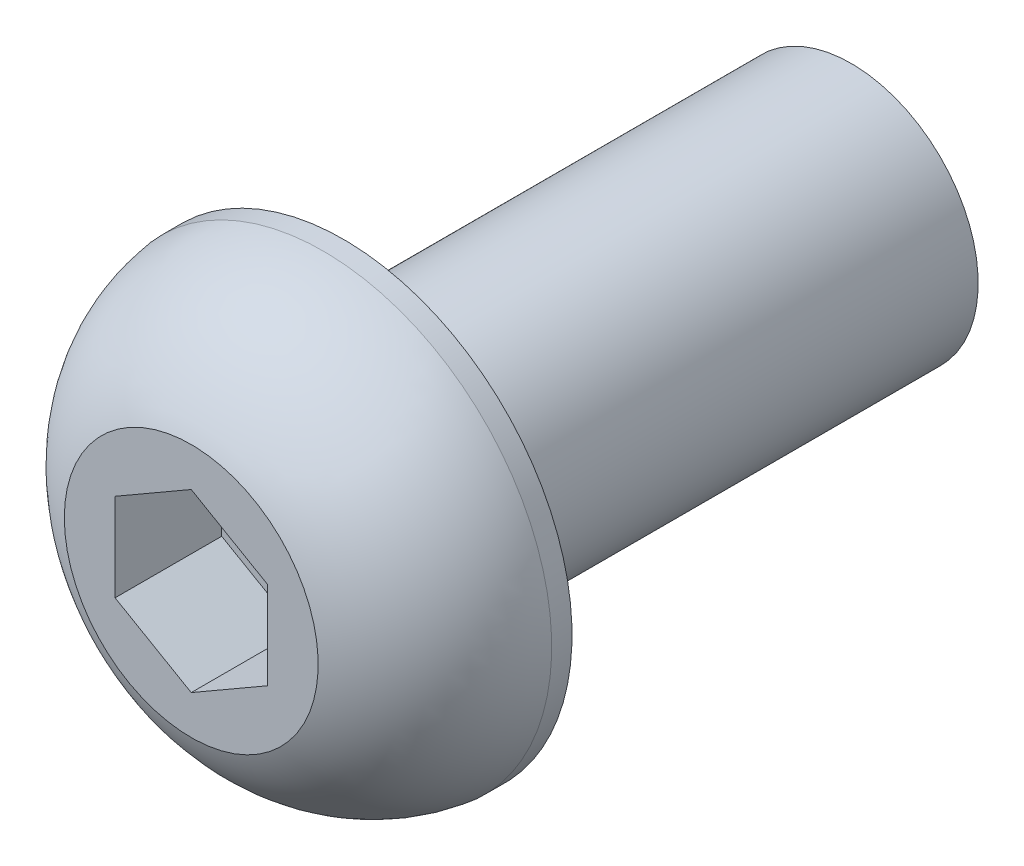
ISO-10303-21;
HEADER;
FILE_DESCRIPTION(('STEP AP214'),'2;1');
FILE_NAME('part.step','',(''),(''),'','','');
FILE_SCHEMA(('AUTOMOTIVE_DESIGN { 1 0 10303 214 1 1 1 1 }'));
ENDSEC;
DATA;
#1=APPLICATION_CONTEXT('core data for automotive mechanical design processes');
#2=APPLICATION_PROTOCOL_DEFINITION('international standard','automotive_design',2000,#1);
#3=PRODUCT_CONTEXT('',#1,'mechanical');
#4=PRODUCT('Part','Part','',(#3));
#5=PRODUCT_RELATED_PRODUCT_CATEGORY('part','',(#4));
#6=PRODUCT_DEFINITION_FORMATION('','',#4);
#7=PRODUCT_DEFINITION_CONTEXT('part definition',#1,'design');
#8=PRODUCT_DEFINITION('design','',#6,#7);
#9=PRODUCT_DEFINITION_SHAPE('','',#8);
#10=(LENGTH_UNIT() NAMED_UNIT(*) SI_UNIT(.MILLI.,.METRE.));
#11=(NAMED_UNIT(*) PLANE_ANGLE_UNIT() SI_UNIT($,.RADIAN.));
#12=(NAMED_UNIT(*) SI_UNIT($,.STERADIAN.) SOLID_ANGLE_UNIT());
#13=UNCERTAINTY_MEASURE_WITH_UNIT(LENGTH_MEASURE(1.E-05),#10,'distance_accuracy_value','');
#14=(GEOMETRIC_REPRESENTATION_CONTEXT(3) GLOBAL_UNCERTAINTY_ASSIGNED_CONTEXT((#13)) GLOBAL_UNIT_ASSIGNED_CONTEXT((#10,
#11,#12)) REPRESENTATION_CONTEXT('',''));
#15=CARTESIAN_POINT('',(0.,0.,0.));
#16=DIRECTION('',(0.,0.,1.));
#17=DIRECTION('',(1.,0.,0.));
#18=AXIS2_PLACEMENT_3D('',#15,#16,#17);
#19=CARTESIAN_POINT('',(0.,0.,6.));
#20=DIRECTION('',(0.,0.,1.));
#21=DIRECTION('',(1.,0.,0.));
#22=AXIS2_PLACEMENT_3D('',#19,#20,#21);
#23=PLANE('',#22);
#24=DIRECTION('',(-0.866025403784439,0.5,0.));
#25=VECTOR('',#24,1.);
#26=CARTESIAN_POINT('',(3.,1.73205080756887,6.));
#27=LINE('',#26,#25);
#28=CARTESIAN_POINT('',(3.,1.73205080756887,6.));
#29=VERTEX_POINT('',#28);
#30=CARTESIAN_POINT('',(0.,3.46410161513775,6.));
#31=VERTEX_POINT('',#30);
#32=EDGE_CURVE('E28',#29,#31,#27,.T.);
#33=ORIENTED_EDGE('',*,*,#32,.F.);
#34=DIRECTION('',(0.,1.,0.));
#35=VECTOR('',#34,1.);
#36=CARTESIAN_POINT('',(3.,-1.73205080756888,6.));
#37=LINE('',#36,#35);
#38=CARTESIAN_POINT('',(3.,-1.73205080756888,6.));
#39=VERTEX_POINT('',#38);
#40=EDGE_CURVE('E97',#39,#29,#37,.T.);
#41=ORIENTED_EDGE('',*,*,#40,.F.);
#42=DIRECTION('',(0.866025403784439,0.5,0.));
#43=VECTOR('',#42,1.);
#44=CARTESIAN_POINT('',(0.,-3.46410161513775,6.));
#45=LINE('',#44,#43);
#46=CARTESIAN_POINT('',(0.,-3.46410161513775,6.));
#47=VERTEX_POINT('',#46);
#48=EDGE_CURVE('E91',#47,#39,#45,.T.);
#49=ORIENTED_EDGE('',*,*,#48,.F.);
#50=DIRECTION('',(0.866025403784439,-0.5,0.));
#51=VECTOR('',#50,1.);
#52=CARTESIAN_POINT('',(-3.,-1.73205080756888,6.));
#53=LINE('',#52,#51);
#54=CARTESIAN_POINT('',(-3.,-1.73205080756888,6.));
#55=VERTEX_POINT('',#54);
#56=EDGE_CURVE('E89',#55,#47,#53,.T.);
#57=ORIENTED_EDGE('',*,*,#56,.F.);
#58=DIRECTION('',(0.,-1.,0.));
#59=VECTOR('',#58,1.);
#60=CARTESIAN_POINT('',(-3.,1.73205080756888,6.));
#61=LINE('',#60,#59);
#62=CARTESIAN_POINT('',(-3.,1.73205080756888,6.));
#63=VERTEX_POINT('',#62);
#64=EDGE_CURVE('E71',#63,#55,#61,.T.);
#65=ORIENTED_EDGE('',*,*,#64,.F.);
#66=DIRECTION('',(-0.866025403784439,-0.5,0.));
#67=VECTOR('',#66,1.);
#68=CARTESIAN_POINT('',(0.,3.46410161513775,6.));
#69=LINE('',#68,#67);
#70=EDGE_CURVE('E82',#31,#63,#69,.T.);
#71=ORIENTED_EDGE('',*,*,#70,.F.);
#72=EDGE_LOOP('',(#33,#41,#49,#57,#65,#71));
#73=FACE_BOUND('',#72,.T.);
#74=CARTESIAN_POINT('',(0.,0.,6.));
#75=DIRECTION('',(0.,0.,-1.));
#76=DIRECTION('',(-1.,0.,0.));
#77=AXIS2_PLACEMENT_3D('',#74,#75,#76);
#78=CIRCLE('',#77,5.);
#79=CARTESIAN_POINT('',(-5.,0.,6.));
#80=VERTEX_POINT('',#79);
#81=EDGE_CURVE('E9',#80,#80,#78,.T.);
#82=ORIENTED_EDGE('',*,*,#81,.F.);
#83=EDGE_LOOP('',(#82));
#84=FACE_BOUND('',#83,.T.);
#85=ADVANCED_FACE('F14',(#73,#84),#23,.T.);
#86=CARTESIAN_POINT('',(0.,0.,-0.0214499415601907));
#87=DIRECTION('',(0.,0.,-1.));
#88=DIRECTION('',(-1.,0.,0.));
#89=AXIS2_PLACEMENT_3D('',#86,#87,#88);
#90=DEGENERATE_TOROIDAL_SURFACE('',#89,2.55211507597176,6.5,.T.);
#91=ORIENTED_EDGE('',*,*,#81,.T.);
#92=EDGE_LOOP('',(#91));
#93=FACE_BOUND('',#92,.T.);
#94=CARTESIAN_POINT('',(0.,0.,0.8));
#95=DIRECTION('',(0.,0.,-1.));
#96=DIRECTION('',(-1.,0.,0.));
#97=AXIS2_PLACEMENT_3D('',#94,#95,#96);
#98=CIRCLE('',#97,9.);
#99=CARTESIAN_POINT('',(-9.,0.,0.8));
#100=VERTEX_POINT('',#99);
#101=EDGE_CURVE('E21',#100,#100,#98,.T.);
#102=ORIENTED_EDGE('',*,*,#101,.F.);
#103=EDGE_LOOP('',(#102));
#104=FACE_BOUND('',#103,.T.);
#105=ADVANCED_FACE('F135',(#93,#104),#90,.T.);
#106=CARTESIAN_POINT('',(0.,0.,0.));
#107=DIRECTION('',(0.,0.,-1.));
#108=DIRECTION('',(-1.,0.,0.));
#109=AXIS2_PLACEMENT_3D('',#106,#107,#108);
#110=CYLINDRICAL_SURFACE('',#109,9.);
#111=ORIENTED_EDGE('',*,*,#101,.T.);
#112=EDGE_LOOP('',(#111));
#113=FACE_BOUND('',#112,.T.);
#114=CARTESIAN_POINT('',(0.,0.,0.));
#115=DIRECTION('',(0.,0.,-1.));
#116=DIRECTION('',(-1.,0.,0.));
#117=AXIS2_PLACEMENT_3D('',#114,#115,#116);
#118=CIRCLE('',#117,9.);
#119=CARTESIAN_POINT('',(-9.,0.,0.));
#120=VERTEX_POINT('',#119);
#121=EDGE_CURVE('E127',#120,#120,#118,.T.);
#122=ORIENTED_EDGE('',*,*,#121,.F.);
#123=EDGE_LOOP('',(#122));
#124=FACE_BOUND('',#123,.T.);
#125=ADVANCED_FACE('F132',(#113,#124),#110,.T.);
#126=CARTESIAN_POINT('',(0.,5.,0.));
#127=DIRECTION('',(0.,0.,-1.));
#128=DIRECTION('',(-1.,0.,0.));
#129=AXIS2_PLACEMENT_3D('',#126,#127,#128);
#130=PLANE('',#129);
#131=ORIENTED_EDGE('',*,*,#121,.T.);
#132=EDGE_LOOP('',(#131));
#133=FACE_BOUND('',#132,.T.);
#134=CARTESIAN_POINT('',(0.,0.,0.));
#135=DIRECTION('',(0.,0.,-1.));
#136=DIRECTION('',(-1.,0.,0.));
#137=AXIS2_PLACEMENT_3D('',#134,#135,#136);
#138=CIRCLE('',#137,5.);
#139=CARTESIAN_POINT('',(-5.,0.,0.));
#140=VERTEX_POINT('',#139);
#141=EDGE_CURVE('E124',#140,#140,#138,.T.);
#142=ORIENTED_EDGE('',*,*,#141,.F.);
#143=EDGE_LOOP('',(#142));
#144=FACE_BOUND('',#143,.T.);
#145=ADVANCED_FACE('F144',(#133,#144),#130,.T.);
#146=CARTESIAN_POINT('',(0.,0.,0.));
#147=DIRECTION('',(0.,0.,-1.));
#148=DIRECTION('',(-1.,0.,0.));
#149=AXIS2_PLACEMENT_3D('',#146,#147,#148);
#150=CYLINDRICAL_SURFACE('',#149,5.);
#151=ORIENTED_EDGE('',*,*,#141,.T.);
#152=EDGE_LOOP('',(#151));
#153=FACE_BOUND('',#152,.T.);
#154=CARTESIAN_POINT('',(0.,0.,-20.));
#155=DIRECTION('',(0.,0.,-1.));
#156=DIRECTION('',(-1.,0.,0.));
#157=AXIS2_PLACEMENT_3D('',#154,#155,#156);
#158=CIRCLE('',#157,5.);
#159=CARTESIAN_POINT('',(-5.,0.,-20.));
#160=VERTEX_POINT('',#159);
#161=EDGE_CURVE('E115',#160,#160,#158,.T.);
#162=ORIENTED_EDGE('',*,*,#161,.F.);
#163=EDGE_LOOP('',(#162));
#164=FACE_BOUND('',#163,.T.);
#165=ADVANCED_FACE('F149',(#153,#164),#150,.T.);
#166=CARTESIAN_POINT('',(0.,0.,-20.));
#167=DIRECTION('',(0.,0.,-1.));
#168=DIRECTION('',(-1.,0.,0.));
#169=AXIS2_PLACEMENT_3D('',#166,#167,#168);
#170=PLANE('',#169);
#171=ORIENTED_EDGE('',*,*,#161,.T.);
#172=EDGE_LOOP('',(#171));
#173=FACE_BOUND('',#172,.T.);
#174=ADVANCED_FACE('F153',(#173),#170,.T.);
#175=CARTESIAN_POINT('',(3.,1.73205080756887,1.8));
#176=DIRECTION('',(0.5,0.866025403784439,0.));
#177=DIRECTION('',(-0.866025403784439,0.5,0.));
#178=AXIS2_PLACEMENT_3D('',#175,#176,#177);
#179=PLANE('',#178);
#180=ORIENTED_EDGE('',*,*,#32,.T.);
#181=DIRECTION('',(0.,0.,1.));
#182=VECTOR('',#181,1.);
#183=CARTESIAN_POINT('',(0.,3.46410161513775,1.8));
#184=LINE('',#183,#182);
#185=CARTESIAN_POINT('',(0.,3.46410161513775,1.8));
#186=VERTEX_POINT('',#185);
#187=EDGE_CURVE('E79',#186,#31,#184,.T.);
#188=ORIENTED_EDGE('',*,*,#187,.F.);
#189=DIRECTION('',(-0.866025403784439,0.5,0.));
#190=VECTOR('',#189,1.);
#191=CARTESIAN_POINT('',(3.,1.73205080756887,1.8));
#192=LINE('',#191,#190);
#193=CARTESIAN_POINT('',(3.,1.73205080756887,1.8));
#194=VERTEX_POINT('',#193);
#195=EDGE_CURVE('E99',#194,#186,#192,.T.);
#196=ORIENTED_EDGE('',*,*,#195,.F.);
#197=DIRECTION('',(0.,0.,1.));
#198=VECTOR('',#197,1.);
#199=CARTESIAN_POINT('',(3.,1.73205080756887,1.8));
#200=LINE('',#199,#198);
#201=EDGE_CURVE('E35',#194,#29,#200,.T.);
#202=ORIENTED_EDGE('',*,*,#201,.T.);
#203=EDGE_LOOP('',(#180,#188,#196,#202));
#204=FACE_BOUND('',#203,.T.);
#205=ADVANCED_FACE('F157',(#204),#179,.F.);
#206=CARTESIAN_POINT('',(3.,-1.73205080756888,1.8));
#207=DIRECTION('',(1.,0.,0.));
#208=DIRECTION('',(0.,1.,0.));
#209=AXIS2_PLACEMENT_3D('',#206,#207,#208);
#210=PLANE('',#209);
#211=ORIENTED_EDGE('',*,*,#40,.T.);
#212=ORIENTED_EDGE('',*,*,#201,.F.);
#213=DIRECTION('',(0.,1.,0.));
#214=VECTOR('',#213,1.);
#215=CARTESIAN_POINT('',(3.,-1.73205080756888,1.8));
#216=LINE('',#215,#214);
#217=CARTESIAN_POINT('',(3.,-1.73205080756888,1.8));
#218=VERTEX_POINT('',#217);
#219=EDGE_CURVE('E111',#218,#194,#216,.T.);
#220=ORIENTED_EDGE('',*,*,#219,.F.);
#221=DIRECTION('',(0.,0.,1.));
#222=VECTOR('',#221,1.);
#223=CARTESIAN_POINT('',(3.,-1.73205080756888,1.8));
#224=LINE('',#223,#222);
#225=EDGE_CURVE('E116',#218,#39,#224,.T.);
#226=ORIENTED_EDGE('',*,*,#225,.T.);
#227=EDGE_LOOP('',(#211,#212,#220,#226));
#228=FACE_BOUND('',#227,.T.);
#229=ADVANCED_FACE('F161',(#228),#210,.F.);
#230=CARTESIAN_POINT('',(0.,-3.46410161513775,1.8));
#231=DIRECTION('',(0.5,-0.866025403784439,0.));
#232=DIRECTION('',(0.866025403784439,0.5,0.));
#233=AXIS2_PLACEMENT_3D('',#230,#231,#232);
#234=PLANE('',#233);
#235=ORIENTED_EDGE('',*,*,#48,.T.);
#236=ORIENTED_EDGE('',*,*,#225,.F.);
#237=DIRECTION('',(0.866025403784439,0.5,0.));
#238=VECTOR('',#237,1.);
#239=CARTESIAN_POINT('',(0.,-3.46410161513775,1.8));
#240=LINE('',#239,#238);
#241=CARTESIAN_POINT('',(0.,-3.46410161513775,1.8));
#242=VERTEX_POINT('',#241);
#243=EDGE_CURVE('E108',#242,#218,#240,.T.);
#244=ORIENTED_EDGE('',*,*,#243,.F.);
#245=DIRECTION('',(0.,0.,1.));
#246=VECTOR('',#245,1.);
#247=CARTESIAN_POINT('',(0.,-3.46410161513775,1.8));
#248=LINE('',#247,#246);
#249=EDGE_CURVE('E118',#242,#47,#248,.T.);
#250=ORIENTED_EDGE('',*,*,#249,.T.);
#251=EDGE_LOOP('',(#235,#236,#244,#250));
#252=FACE_BOUND('',#251,.T.);
#253=ADVANCED_FACE('F170',(#252),#234,.F.);
#254=CARTESIAN_POINT('',(-3.,-1.73205080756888,1.8));
#255=DIRECTION('',(-0.5,-0.866025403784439,0.));
#256=DIRECTION('',(0.866025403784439,-0.5,0.));
#257=AXIS2_PLACEMENT_3D('',#254,#255,#256);
#258=PLANE('',#257);
#259=ORIENTED_EDGE('',*,*,#56,.T.);
#260=ORIENTED_EDGE('',*,*,#249,.F.);
#261=DIRECTION('',(0.866025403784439,-0.5,0.));
#262=VECTOR('',#261,1.);
#263=CARTESIAN_POINT('',(-3.,-1.73205080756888,1.8));
#264=LINE('',#263,#262);
#265=CARTESIAN_POINT('',(-3.,-1.73205080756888,1.8));
#266=VERTEX_POINT('',#265);
#267=EDGE_CURVE('E105',#266,#242,#264,.T.);
#268=ORIENTED_EDGE('',*,*,#267,.F.);
#269=DIRECTION('',(0.,0.,1.));
#270=VECTOR('',#269,1.);
#271=CARTESIAN_POINT('',(-3.,-1.73205080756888,1.8));
#272=LINE('',#271,#270);
#273=EDGE_CURVE('E78',#266,#55,#272,.T.);
#274=ORIENTED_EDGE('',*,*,#273,.T.);
#275=EDGE_LOOP('',(#259,#260,#268,#274));
#276=FACE_BOUND('',#275,.T.);
#277=ADVANCED_FACE('F167',(#276),#258,.F.);
#278=CARTESIAN_POINT('',(-3.,1.73205080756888,1.8));
#279=DIRECTION('',(-1.,0.,0.));
#280=DIRECTION('',(0.,-1.,0.));
#281=AXIS2_PLACEMENT_3D('',#278,#279,#280);
#282=PLANE('',#281);
#283=ORIENTED_EDGE('',*,*,#64,.T.);
#284=ORIENTED_EDGE('',*,*,#273,.F.);
#285=DIRECTION('',(0.,-1.,0.));
#286=VECTOR('',#285,1.);
#287=CARTESIAN_POINT('',(-3.,1.73205080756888,1.8));
#288=LINE('',#287,#286);
#289=CARTESIAN_POINT('',(-3.,1.73205080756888,1.8));
#290=VERTEX_POINT('',#289);
#291=EDGE_CURVE('E74',#290,#266,#288,.T.);
#292=ORIENTED_EDGE('',*,*,#291,.F.);
#293=DIRECTION('',(0.,0.,1.));
#294=VECTOR('',#293,1.);
#295=CARTESIAN_POINT('',(-3.,1.73205080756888,1.8));
#296=LINE('',#295,#294);
#297=EDGE_CURVE('E67',#290,#63,#296,.T.);
#298=ORIENTED_EDGE('',*,*,#297,.T.);
#299=EDGE_LOOP('',(#283,#284,#292,#298));
#300=FACE_BOUND('',#299,.T.);
#301=ADVANCED_FACE('F69',(#300),#282,.F.);
#302=CARTESIAN_POINT('',(0.,3.46410161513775,1.8));
#303=DIRECTION('',(-0.5,0.866025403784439,0.));
#304=DIRECTION('',(-0.866025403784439,-0.5,0.));
#305=AXIS2_PLACEMENT_3D('',#302,#303,#304);
#306=PLANE('',#305);
#307=ORIENTED_EDGE('',*,*,#70,.T.);
#308=ORIENTED_EDGE('',*,*,#297,.F.);
#309=DIRECTION('',(-0.866025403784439,-0.5,0.));
#310=VECTOR('',#309,1.);
#311=CARTESIAN_POINT('',(0.,3.46410161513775,1.8));
#312=LINE('',#311,#310);
#313=EDGE_CURVE('E102',#186,#290,#312,.T.);
#314=ORIENTED_EDGE('',*,*,#313,.F.);
#315=ORIENTED_EDGE('',*,*,#187,.T.);
#316=EDGE_LOOP('',(#307,#308,#314,#315));
#317=FACE_BOUND('',#316,.T.);
#318=ADVANCED_FACE('F83',(#317),#306,.F.);
#319=CARTESIAN_POINT('',(6.,0.,1.8));
#320=DIRECTION('',(0.,0.,-1.));
#321=DIRECTION('',(-1.,0.,0.));
#322=AXIS2_PLACEMENT_3D('',#319,#320,#321);
#323=PLANE('',#322);
#324=ORIENTED_EDGE('',*,*,#195,.T.);
#325=ORIENTED_EDGE('',*,*,#313,.T.);
#326=ORIENTED_EDGE('',*,*,#291,.T.);
#327=ORIENTED_EDGE('',*,*,#267,.T.);
#328=ORIENTED_EDGE('',*,*,#243,.T.);
#329=ORIENTED_EDGE('',*,*,#219,.T.);
#330=EDGE_LOOP('',(#324,#325,#326,#327,#328,#329));
#331=FACE_BOUND('',#330,.T.);
#332=ADVANCED_FACE('F164',(#331),#323,.F.);
#333=CLOSED_SHELL('',(#85,#105,#125,#145,#165,#174,#205,#229,#253,#277,#301,#318,#332));
#334=MANIFOLD_SOLID_BREP('B1',#333);
#335=ADVANCED_BREP_SHAPE_REPRESENTATION('',(#18,#334),#14);
#336=SHAPE_DEFINITION_REPRESENTATION(#9,#335);
ENDSEC;
END-ISO-10303-21;
